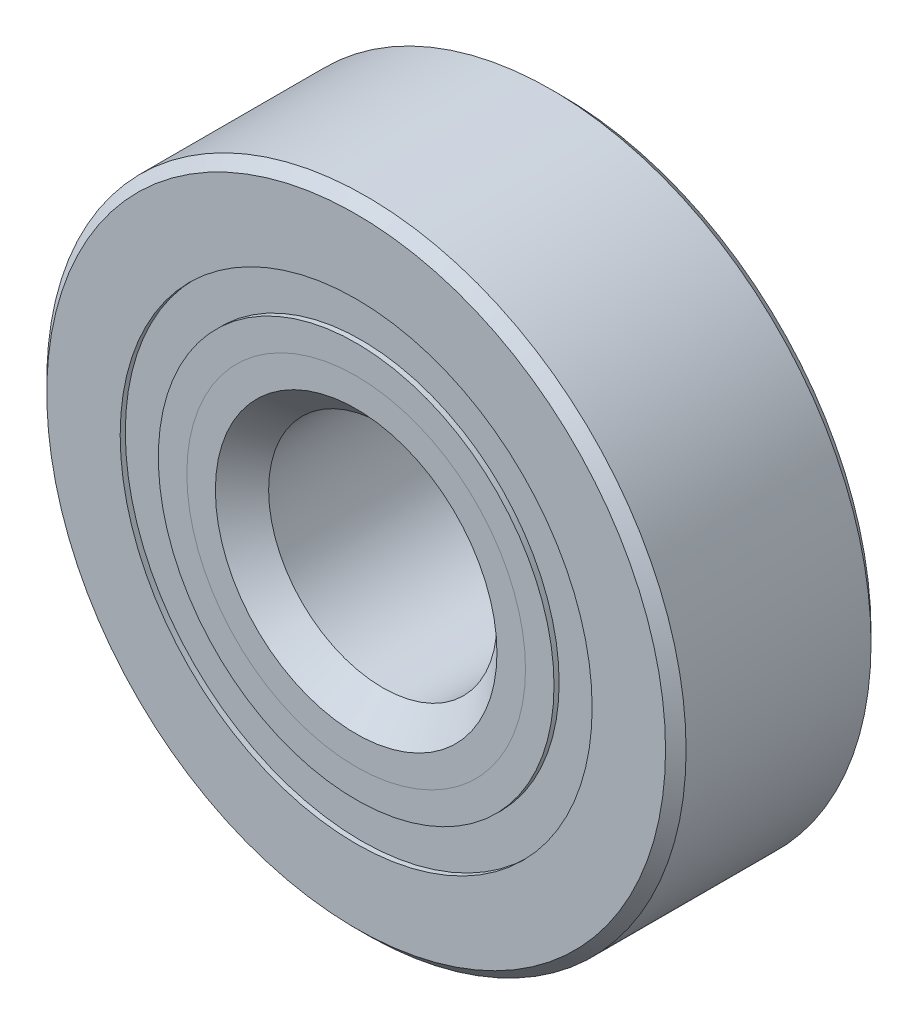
from build123d import *

# Parameters (mm, degrees)
CIRPATTERN1_COUNT = 8
SKETCH5_W         = 1.672929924
SKETCH5_H         = 1.325824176


with BuildPart() as part:
    # Sketch1 → Revolve1 (revolve)
    with BuildSketch(Plane(origin=(0, 0, 0), x_dir=(0, 0, -1), z_dir=(1, 0, 0)), mode=Mode.PRIVATE) as revolve1_sk:
        with BuildLine():
            Line((3.2146875, 11.1125), (-3.2146875, 11.1125))
            Line((-3.2146875, 11.1125), (-3.571875, 10.7553125))
            Line((-3.571875, 10.7553125), (-3.571875, 8.203537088))
            Line((-3.571875, 8.203537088), (-1.5875, 8.203537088))
            ThreePointArc((-1.5875, 8.203537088), (0, 9.260976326), (1.5875, 8.203537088))
            Line((1.5875, 8.203537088), (3.571875, 8.203537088))
            Line((3.571875, 8.203537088), (3.571875, 10.7553125))
            Line((3.571875, 10.7553125), (3.2146875, 11.1125))
        make_face()
    revolve(revolve1_sk.sketch.rotate(Axis((0, 0, 3.571875), (0, 0, -1)), 90), axis=Axis((0, 0, 3.571875), (0, 0, -1)))


with BuildPart() as body_2:
    # Sketch2 → Revolve2 (revolve)
    with BuildSketch(Plane(origin=(0, 0, 0), x_dir=(0, 0, -1), z_dir=(1, 0, 0)), mode=Mode.PRIVATE) as revolve2_sk:
        with BuildLine():
            Line((-3.571875, 6.877712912), (-1.5875, 6.877712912))
            ThreePointArc((-1.5875, 6.877712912), (-0.95372087, 6.108834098), (0, 5.820273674))
            Line((0, 5.820273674), (0, 4.894511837))
            Line((0, 4.894511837), (-2.580274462, 4.894511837))
            Line((-2.580274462, 4.894511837), (-3.571875, 5.886112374))
            Line((-3.571875, 5.886112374), (-3.571875, 6.877712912))
        make_face()
    revolve(revolve2_sk.sketch.rotate(Axis((0, 0, 3.571875), (0, 0, -1)), 90), axis=Axis((0, 0, 3.571875), (0, 0, -1)))


with BuildPart() as body_3:
    # Sketch3 → Revolve3 (revolve)
    with BuildSketch(Plane(origin=(0, 0, 0), x_dir=(0, 0, -1), z_dir=(1, 0, 0)), mode=Mode.PRIVATE) as revolve3_sk:
        with BuildLine():
            Line((-3.571875, 5.886112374), (-2.580274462, 4.894511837))
            Line((-2.580274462, 4.894511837), (0, 4.894511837))
            Line((0, 4.894511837), (0, 5.820273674))
            ThreePointArc((0, 5.820273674), (0.95372087, 6.108834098), (1.5875, 6.877712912))
            Line((1.5875, 6.877712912), (3.571875, 6.877712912))
            Line((3.571875, 6.877712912), (3.571875, 4.3259375))
            Line((3.571875, 4.3259375), (3.2146875, 3.96875))
            Line((3.2146875, 3.96875), (-2.646113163, 3.96875))
            Line((-2.646113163, 3.96875), (-3.571875, 4.894511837))
            Line((-3.571875, 4.894511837), (-3.571875, 5.886112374))
        make_face()
    revolve(revolve3_sk.sketch.rotate(Axis((0, 0, 3.571875), (0, 0, -1)), 90), axis=Axis((0, 0, 3.571875), (0, 0, -1)))


with BuildPart() as body_4:
    # Sketch4 → Revolve4 (revolve)
    with BuildSketch(Plane(origin=(0, 0, 0), x_dir=(0, 0, -1), z_dir=(1, 0, 0))):
        with BuildLine():
            Line((-1.720351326, 7.540625), (1.720351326, 7.540625))
            ThreePointArc((1.720351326, 7.540625), (0, 9.260976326), (-1.720351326, 7.540625))
        make_face()
    revolve(axis=Axis((0, 7.540625, 1.720351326), (0, 0, -1)))


with BuildPart() as cirpattern1_1:
    # CirPattern1: pattern copy
    add(body_4.part.rotate(Axis((0, 0, 0), (0, 0, 1)), 1 * 360 / CIRPATTERN1_COUNT))


with BuildPart() as cirpattern1_2:
    # CirPattern1: pattern copy
    add(body_4.part.rotate(Axis((0, 0, 0), (0, 0, 1)), 2 * 360 / CIRPATTERN1_COUNT))


with BuildPart() as cirpattern1_3:
    # CirPattern1: pattern copy
    add(body_4.part.rotate(Axis((0, 0, 0), (0, 0, 1)), 3 * 360 / CIRPATTERN1_COUNT))


with BuildPart() as cirpattern1_4:
    # CirPattern1: pattern copy
    add(body_4.part.rotate(Axis((0, 0, 0), (0, 0, 1)), 4 * 360 / CIRPATTERN1_COUNT))


with BuildPart() as cirpattern1_5:
    # CirPattern1: pattern copy
    add(body_4.part.rotate(Axis((0, 0, 0), (0, 0, 1)), 5 * 360 / CIRPATTERN1_COUNT))


with BuildPart() as cirpattern1_6:
    # CirPattern1: pattern copy
    add(body_4.part.rotate(Axis((0, 0, 0), (0, 0, 1)), 6 * 360 / CIRPATTERN1_COUNT))


with BuildPart() as cirpattern1_7:
    # CirPattern1: pattern copy
    add(body_4.part.rotate(Axis((0, 0, 0), (0, 0, 1)), 7 * 360 / CIRPATTERN1_COUNT))


with BuildPart() as body_12:
    # Sketch5 → Revolve5 (revolve)
    with BuildSketch(Plane(origin=(0, 0, 0), x_dir=(0, 0, -1), z_dir=(1, 0, 0)), mode=Mode.PRIVATE) as revolve5_sk:
        with Locations((-2.556816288, 7.540625)):
            Rectangle(SKETCH5_W, SKETCH5_H)
        with Locations((2.556816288, 7.540625)):
            Rectangle(SKETCH5_W, SKETCH5_H)
    revolve(revolve5_sk.sketch.rotate(Axis((0, 0, 3.571875), (0, 0, -1)), 90), axis=Axis((0, 0, 3.571875), (0, 0, -1)))


solid = Compound([part.part, body_2.part, body_3.part, body_4.part, cirpattern1_1.part, cirpattern1_2.part, cirpattern1_3.part, cirpattern1_4.part, cirpattern1_5.part, cirpattern1_6.part, cirpattern1_7.part, body_12.part])
